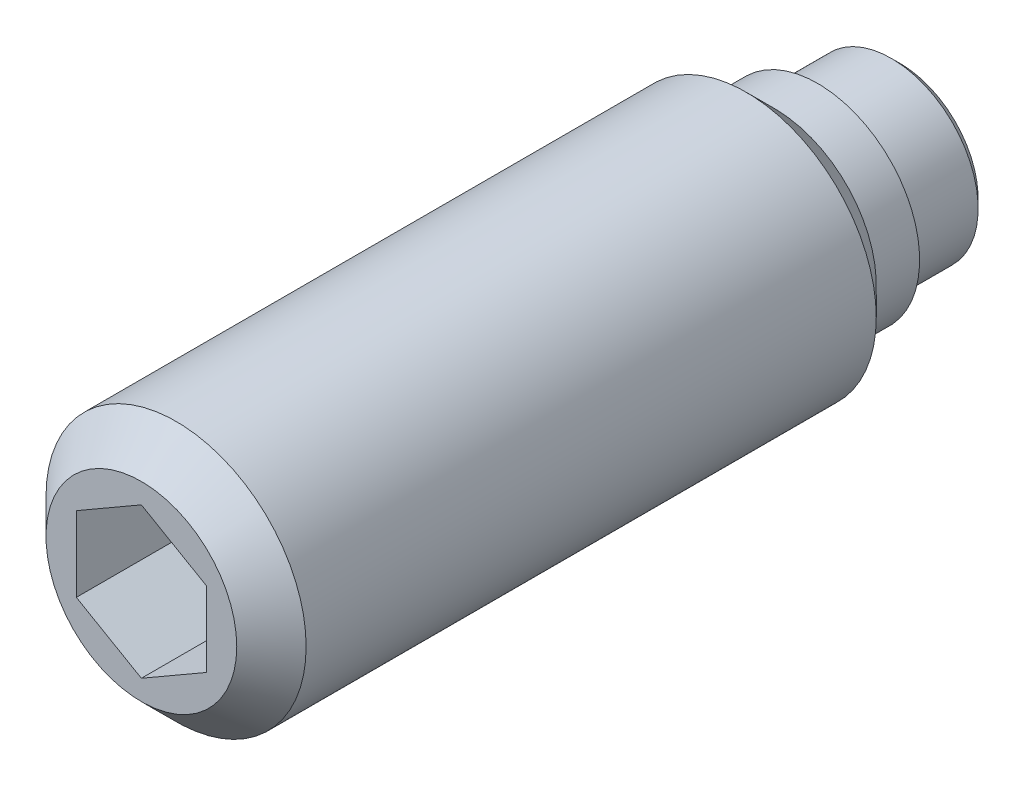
ISO-10303-21;
HEADER;
FILE_DESCRIPTION(('STEP AP214'),'2;1');
FILE_NAME('part.step','',(''),(''),'','','');
FILE_SCHEMA(('AUTOMOTIVE_DESIGN { 1 0 10303 214 1 1 1 1 }'));
ENDSEC;
DATA;
#1=APPLICATION_CONTEXT('core data for automotive mechanical design processes');
#2=APPLICATION_PROTOCOL_DEFINITION('international standard','automotive_design',2000,#1);
#3=PRODUCT_CONTEXT('',#1,'mechanical');
#4=PRODUCT('Part','Part','',(#3));
#5=PRODUCT_RELATED_PRODUCT_CATEGORY('part','',(#4));
#6=PRODUCT_DEFINITION_FORMATION('','',#4);
#7=PRODUCT_DEFINITION_CONTEXT('part definition',#1,'design');
#8=PRODUCT_DEFINITION('design','',#6,#7);
#9=PRODUCT_DEFINITION_SHAPE('','',#8);
#10=(LENGTH_UNIT() NAMED_UNIT(*) SI_UNIT(.MILLI.,.METRE.));
#11=(NAMED_UNIT(*) PLANE_ANGLE_UNIT() SI_UNIT($,.RADIAN.));
#12=(NAMED_UNIT(*) SI_UNIT($,.STERADIAN.) SOLID_ANGLE_UNIT());
#13=UNCERTAINTY_MEASURE_WITH_UNIT(LENGTH_MEASURE(1.E-05),#10,'distance_accuracy_value','');
#14=(GEOMETRIC_REPRESENTATION_CONTEXT(3) GLOBAL_UNCERTAINTY_ASSIGNED_CONTEXT((#13)) GLOBAL_UNIT_ASSIGNED_CONTEXT((#10,
#11,#12)) REPRESENTATION_CONTEXT('',''));
#15=CARTESIAN_POINT('',(0.,0.,0.));
#16=DIRECTION('',(0.,0.,1.));
#17=DIRECTION('',(1.,0.,0.));
#18=AXIS2_PLACEMENT_3D('',#15,#16,#17);
#19=CARTESIAN_POINT('',(0.,0.,1.9));
#20=DIRECTION('',(0.,0.,-1.));
#21=DIRECTION('',(-1.,0.,0.));
#22=AXIS2_PLACEMENT_3D('',#19,#20,#21);
#23=CYLINDRICAL_SURFACE('',#22,3.);
#24=CARTESIAN_POINT('',(0.,0.,3.55));
#25=DIRECTION('',(0.,0.,-1.));
#26=DIRECTION('',(-1.,0.,0.));
#27=AXIS2_PLACEMENT_3D('',#24,#25,#26);
#28=CIRCLE('',#27,3.);
#29=CARTESIAN_POINT('',(-3.,0.,3.55));
#30=VERTEX_POINT('',#29);
#31=EDGE_CURVE('E9',#30,#30,#28,.T.);
#32=ORIENTED_EDGE('',*,*,#31,.F.);
#33=EDGE_LOOP('',(#32));
#34=FACE_BOUND('',#33,.T.);
#35=CARTESIAN_POINT('',(0.,0.,16.7));
#36=DIRECTION('',(0.,0.,1.));
#37=DIRECTION('',(1.,0.,0.));
#38=AXIS2_PLACEMENT_3D('',#35,#36,#37);
#39=CIRCLE('',#38,3.);
#40=CARTESIAN_POINT('',(3.,0.,16.7));
#41=VERTEX_POINT('',#40);
#42=EDGE_CURVE('E123',#41,#41,#39,.T.);
#43=ORIENTED_EDGE('',*,*,#42,.F.);
#44=EDGE_LOOP('',(#43));
#45=FACE_BOUND('',#44,.T.);
#46=ADVANCED_FACE('F14',(#34,#45),#23,.T.);
#47=CARTESIAN_POINT('',(0.,0.,3.55));
#48=DIRECTION('',(0.,0.,1.));
#49=DIRECTION('',(1.,0.,0.));
#50=AXIS2_PLACEMENT_3D('',#47,#48,#49);
#51=CONICAL_SURFACE('',#50,3.,0.785398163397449);
#52=ORIENTED_EDGE('',*,*,#31,.T.);
#53=EDGE_LOOP('',(#52));
#54=FACE_BOUND('',#53,.T.);
#55=CARTESIAN_POINT('',(0.,0.,2.9));
#56=DIRECTION('',(0.,0.,-1.));
#57=DIRECTION('',(-1.,0.,0.));
#58=AXIS2_PLACEMENT_3D('',#55,#56,#57);
#59=CIRCLE('',#58,2.35);
#60=CARTESIAN_POINT('',(-2.35,0.,2.9));
#61=VERTEX_POINT('',#60);
#62=EDGE_CURVE('E21',#61,#61,#59,.T.);
#63=ORIENTED_EDGE('',*,*,#62,.F.);
#64=EDGE_LOOP('',(#63));
#65=FACE_BOUND('',#64,.T.);
#66=ADVANCED_FACE('F143',(#54,#65),#51,.T.);
#67=CARTESIAN_POINT('',(0.,0.,1.9));
#68=DIRECTION('',(0.,0.,-1.));
#69=DIRECTION('',(-1.,0.,0.));
#70=AXIS2_PLACEMENT_3D('',#67,#68,#69);
#71=CYLINDRICAL_SURFACE('',#70,2.35);
#72=ORIENTED_EDGE('',*,*,#62,.T.);
#73=EDGE_LOOP('',(#72));
#74=FACE_BOUND('',#73,.T.);
#75=CARTESIAN_POINT('',(0.,0.,1.9));
#76=DIRECTION('',(0.,0.,-1.));
#77=DIRECTION('',(-1.,0.,0.));
#78=AXIS2_PLACEMENT_3D('',#75,#76,#77);
#79=CIRCLE('',#78,2.35);
#80=CARTESIAN_POINT('',(-2.35,0.,1.9));
#81=VERTEX_POINT('',#80);
#82=EDGE_CURVE('E135',#81,#81,#79,.T.);
#83=ORIENTED_EDGE('',*,*,#82,.F.);
#84=EDGE_LOOP('',(#83));
#85=FACE_BOUND('',#84,.T.);
#86=ADVANCED_FACE('F140',(#74,#85),#71,.T.);
#87=CARTESIAN_POINT('',(0.,2.35,1.9));
#88=DIRECTION('',(0.,0.,1.));
#89=DIRECTION('',(1.,0.,0.));
#90=AXIS2_PLACEMENT_3D('',#87,#88,#89);
#91=PLANE('',#90);
#92=ORIENTED_EDGE('',*,*,#82,.T.);
#93=EDGE_LOOP('',(#92));
#94=FACE_BOUND('',#93,.T.);
#95=CARTESIAN_POINT('',(0.,0.,1.9));
#96=DIRECTION('',(0.,0.,-1.));
#97=DIRECTION('',(-1.,0.,0.));
#98=AXIS2_PLACEMENT_3D('',#95,#96,#97);
#99=CIRCLE('',#98,2.);
#100=CARTESIAN_POINT('',(-2.,0.,1.9));
#101=VERTEX_POINT('',#100);
#102=EDGE_CURVE('E132',#101,#101,#99,.T.);
#103=ORIENTED_EDGE('',*,*,#102,.F.);
#104=EDGE_LOOP('',(#103));
#105=FACE_BOUND('',#104,.T.);
#106=ADVANCED_FACE('F151',(#94,#105),#91,.F.);
#107=CARTESIAN_POINT('',(0.,0.,0.));
#108=DIRECTION('',(0.,0.,-1.));
#109=DIRECTION('',(-1.,0.,0.));
#110=AXIS2_PLACEMENT_3D('',#107,#108,#109);
#111=CYLINDRICAL_SURFACE('',#110,2.);
#112=CARTESIAN_POINT('',(0.,0.,0.2));
#113=DIRECTION('',(0.,0.,-1.));
#114=DIRECTION('',(-1.,0.,0.));
#115=AXIS2_PLACEMENT_3D('',#112,#113,#114);
#116=CIRCLE('',#115,2.);
#117=CARTESIAN_POINT('',(-2.,0.,0.2));
#118=VERTEX_POINT('',#117);
#119=EDGE_CURVE('E129',#118,#118,#116,.T.);
#120=ORIENTED_EDGE('',*,*,#119,.F.);
#121=EDGE_LOOP('',(#120));
#122=FACE_BOUND('',#121,.T.);
#123=ORIENTED_EDGE('',*,*,#102,.T.);
#124=EDGE_LOOP('',(#123));
#125=FACE_BOUND('',#124,.T.);
#126=ADVANCED_FACE('F157',(#122,#125),#111,.T.);
#127=CARTESIAN_POINT('',(0.,0.,0.2));
#128=DIRECTION('',(0.,0.,1.));
#129=DIRECTION('',(1.,0.,0.));
#130=AXIS2_PLACEMENT_3D('',#127,#128,#129);
#131=CONICAL_SURFACE('',#130,2.,0.785398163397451);
#132=CARTESIAN_POINT('',(0.,0.,0.));
#133=DIRECTION('',(0.,0.,-1.));
#134=DIRECTION('',(-1.,0.,0.));
#135=AXIS2_PLACEMENT_3D('',#132,#133,#134);
#136=CIRCLE('',#135,1.8);
#137=CARTESIAN_POINT('',(-1.8,0.,0.));
#138=VERTEX_POINT('',#137);
#139=EDGE_CURVE('E126',#138,#138,#136,.T.);
#140=ORIENTED_EDGE('',*,*,#139,.F.);
#141=EDGE_LOOP('',(#140));
#142=FACE_BOUND('',#141,.T.);
#143=ORIENTED_EDGE('',*,*,#119,.T.);
#144=EDGE_LOOP('',(#143));
#145=FACE_BOUND('',#144,.T.);
#146=ADVANCED_FACE('F161',(#142,#145),#131,.T.);
#147=CARTESIAN_POINT('',(0.,1.8,0.));
#148=DIRECTION('',(0.,0.,1.));
#149=DIRECTION('',(1.,0.,0.));
#150=AXIS2_PLACEMENT_3D('',#147,#148,#149);
#151=PLANE('',#150);
#152=ORIENTED_EDGE('',*,*,#139,.T.);
#153=EDGE_LOOP('',(#152));
#154=FACE_BOUND('',#153,.T.);
#155=ADVANCED_FACE('F165',(#154),#151,.F.);
#156=CARTESIAN_POINT('',(0.,0.,17.5));
#157=DIRECTION('',(0.,0.,-1.));
#158=DIRECTION('',(-1.,0.,0.));
#159=AXIS2_PLACEMENT_3D('',#156,#157,#158);
#160=CONICAL_SURFACE('',#159,2.2,0.785398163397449);
#161=ORIENTED_EDGE('',*,*,#42,.T.);
#162=EDGE_LOOP('',(#161));
#163=FACE_BOUND('',#162,.T.);
#164=CARTESIAN_POINT('',(0.,0.,17.5));
#165=DIRECTION('',(0.,0.,1.));
#166=DIRECTION('',(1.,0.,0.));
#167=AXIS2_PLACEMENT_3D('',#164,#165,#166);
#168=CIRCLE('',#167,2.2);
#169=CARTESIAN_POINT('',(2.2,0.,17.5));
#170=VERTEX_POINT('',#169);
#171=EDGE_CURVE('E115',#170,#170,#168,.T.);
#172=ORIENTED_EDGE('',*,*,#171,.F.);
#173=EDGE_LOOP('',(#172));
#174=FACE_BOUND('',#173,.T.);
#175=ADVANCED_FACE('F169',(#163,#174),#160,.T.);
#176=CARTESIAN_POINT('',(0.,0.,17.5));
#177=DIRECTION('',(0.,0.,1.));
#178=DIRECTION('',(1.,0.,0.));
#179=AXIS2_PLACEMENT_3D('',#176,#177,#178);
#180=PLANE('',#179);
#181=DIRECTION('',(0.866025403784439,-0.5,0.));
#182=VECTOR('',#181,1.);
#183=CARTESIAN_POINT('',(-1.5,-0.866025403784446,17.5));
#184=LINE('',#183,#182);
#185=CARTESIAN_POINT('',(-1.5,-0.866025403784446,17.5));
#186=VERTEX_POINT('',#185);
#187=CARTESIAN_POINT('',(0.,-1.73205080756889,17.5));
#188=VERTEX_POINT('',#187);
#189=EDGE_CURVE('E28',#186,#188,#184,.T.);
#190=ORIENTED_EDGE('',*,*,#189,.F.);
#191=DIRECTION('',(0.,-1.,0.));
#192=VECTOR('',#191,1.);
#193=CARTESIAN_POINT('',(-1.5,0.866025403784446,17.5));
#194=LINE('',#193,#192);
#195=CARTESIAN_POINT('',(-1.5,0.866025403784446,17.5));
#196=VERTEX_POINT('',#195);
#197=EDGE_CURVE('E111',#196,#186,#194,.T.);
#198=ORIENTED_EDGE('',*,*,#197,.F.);
#199=DIRECTION('',(-0.866025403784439,-0.5,0.));
#200=VECTOR('',#199,1.);
#201=CARTESIAN_POINT('',(0.,1.73205080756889,17.5));
#202=LINE('',#201,#200);
#203=CARTESIAN_POINT('',(0.,1.73205080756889,17.5));
#204=VERTEX_POINT('',#203);
#205=EDGE_CURVE('E109',#204,#196,#202,.T.);
#206=ORIENTED_EDGE('',*,*,#205,.F.);
#207=DIRECTION('',(-0.866025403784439,0.5,0.));
#208=VECTOR('',#207,1.);
#209=CARTESIAN_POINT('',(1.5,0.866025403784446,17.5));
#210=LINE('',#209,#208);
#211=CARTESIAN_POINT('',(1.5,0.866025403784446,17.5));
#212=VERTEX_POINT('',#211);
#213=EDGE_CURVE('E76',#212,#204,#210,.T.);
#214=ORIENTED_EDGE('',*,*,#213,.F.);
#215=DIRECTION('',(0.,1.,0.));
#216=VECTOR('',#215,1.);
#217=CARTESIAN_POINT('',(1.5,-0.866025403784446,17.5));
#218=LINE('',#217,#216);
#219=CARTESIAN_POINT('',(1.5,-0.866025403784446,17.5));
#220=VERTEX_POINT('',#219);
#221=EDGE_CURVE('E105',#220,#212,#218,.T.);
#222=ORIENTED_EDGE('',*,*,#221,.F.);
#223=DIRECTION('',(0.866025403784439,0.5,0.));
#224=VECTOR('',#223,1.);
#225=CARTESIAN_POINT('',(0.,-1.73205080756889,17.5));
#226=LINE('',#225,#224);
#227=EDGE_CURVE('E102',#188,#220,#226,.T.);
#228=ORIENTED_EDGE('',*,*,#227,.F.);
#229=EDGE_LOOP('',(#190,#198,#206,#214,#222,#228));
#230=FACE_BOUND('',#229,.T.);
#231=ORIENTED_EDGE('',*,*,#171,.T.);
#232=EDGE_LOOP('',(#231));
#233=FACE_BOUND('',#232,.T.);
#234=ADVANCED_FACE('F173',(#230,#233),#180,.T.);
#235=CARTESIAN_POINT('',(-1.5,-0.866025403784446,14.));
#236=DIRECTION('',(-0.5,-0.866025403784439,0.));
#237=DIRECTION('',(0.866025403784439,-0.5,0.));
#238=AXIS2_PLACEMENT_3D('',#235,#236,#237);
#239=PLANE('',#238);
#240=ORIENTED_EDGE('',*,*,#189,.T.);
#241=DIRECTION('',(0.,0.,1.));
#242=VECTOR('',#241,1.);
#243=CARTESIAN_POINT('',(0.,-1.73205080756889,14.));
#244=LINE('',#243,#242);
#245=CARTESIAN_POINT('',(0.,-1.73205080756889,14.));
#246=VERTEX_POINT('',#245);
#247=EDGE_CURVE('E58',#246,#188,#244,.T.);
#248=ORIENTED_EDGE('',*,*,#247,.F.);
#249=DIRECTION('',(0.866025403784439,-0.5,0.));
#250=VECTOR('',#249,1.);
#251=CARTESIAN_POINT('',(-1.5,-0.866025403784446,14.));
#252=LINE('',#251,#250);
#253=CARTESIAN_POINT('',(-1.5,-0.866025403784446,14.));
#254=VERTEX_POINT('',#253);
#255=EDGE_CURVE('E113',#254,#246,#252,.T.);
#256=ORIENTED_EDGE('',*,*,#255,.F.);
#257=DIRECTION('',(0.,0.,1.));
#258=VECTOR('',#257,1.);
#259=CARTESIAN_POINT('',(-1.5,-0.866025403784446,14.));
#260=LINE('',#259,#258);
#261=EDGE_CURVE('E36',#254,#186,#260,.T.);
#262=ORIENTED_EDGE('',*,*,#261,.T.);
#263=EDGE_LOOP('',(#240,#248,#256,#262));
#264=FACE_BOUND('',#263,.T.);
#265=ADVANCED_FACE('F177',(#264),#239,.F.);
#266=CARTESIAN_POINT('',(-1.5,0.866025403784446,14.));
#267=DIRECTION('',(-1.,0.,0.));
#268=DIRECTION('',(0.,0.,1.));
#269=AXIS2_PLACEMENT_3D('',#266,#267,#268);
#270=PLANE('',#269);
#271=ORIENTED_EDGE('',*,*,#197,.T.);
#272=ORIENTED_EDGE('',*,*,#261,.F.);
#273=DIRECTION('',(0.,-1.,0.));
#274=VECTOR('',#273,1.);
#275=CARTESIAN_POINT('',(-1.5,0.866025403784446,14.));
#276=LINE('',#275,#274);
#277=CARTESIAN_POINT('',(-1.5,0.866025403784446,14.));
#278=VERTEX_POINT('',#277);
#279=EDGE_CURVE('E88',#278,#254,#276,.T.);
#280=ORIENTED_EDGE('',*,*,#279,.F.);
#281=DIRECTION('',(0.,0.,1.));
#282=VECTOR('',#281,1.);
#283=CARTESIAN_POINT('',(-1.5,0.866025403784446,14.));
#284=LINE('',#283,#282);
#285=EDGE_CURVE('E80',#278,#196,#284,.T.);
#286=ORIENTED_EDGE('',*,*,#285,.T.);
#287=EDGE_LOOP('',(#271,#272,#280,#286));
#288=FACE_BOUND('',#287,.T.);
#289=ADVANCED_FACE('F181',(#288),#270,.F.);
#290=CARTESIAN_POINT('',(0.,1.73205080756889,14.));
#291=DIRECTION('',(-0.5,0.866025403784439,0.));
#292=DIRECTION('',(-0.866025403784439,-0.5,0.));
#293=AXIS2_PLACEMENT_3D('',#290,#291,#292);
#294=PLANE('',#293);
#295=ORIENTED_EDGE('',*,*,#205,.T.);
#296=ORIENTED_EDGE('',*,*,#285,.F.);
#297=DIRECTION('',(-0.866025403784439,-0.5,0.));
#298=VECTOR('',#297,1.);
#299=CARTESIAN_POINT('',(0.,1.73205080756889,14.));
#300=LINE('',#299,#298);
#301=CARTESIAN_POINT('',(0.,1.73205080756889,14.));
#302=VERTEX_POINT('',#301);
#303=EDGE_CURVE('E84',#302,#278,#300,.T.);
#304=ORIENTED_EDGE('',*,*,#303,.F.);
#305=DIRECTION('',(0.,0.,1.));
#306=VECTOR('',#305,1.);
#307=CARTESIAN_POINT('',(0.,1.73205080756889,14.));
#308=LINE('',#307,#306);
#309=EDGE_CURVE('E69',#302,#204,#308,.T.);
#310=ORIENTED_EDGE('',*,*,#309,.T.);
#311=EDGE_LOOP('',(#295,#296,#304,#310));
#312=FACE_BOUND('',#311,.T.);
#313=ADVANCED_FACE('F85',(#312),#294,.F.);
#314=CARTESIAN_POINT('',(1.5,0.866025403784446,14.));
#315=DIRECTION('',(0.5,0.866025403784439,0.));
#316=DIRECTION('',(-0.866025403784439,0.5,0.));
#317=AXIS2_PLACEMENT_3D('',#314,#315,#316);
#318=PLANE('',#317);
#319=ORIENTED_EDGE('',*,*,#213,.T.);
#320=ORIENTED_EDGE('',*,*,#309,.F.);
#321=DIRECTION('',(-0.866025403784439,0.5,0.));
#322=VECTOR('',#321,1.);
#323=CARTESIAN_POINT('',(1.5,0.866025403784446,14.));
#324=LINE('',#323,#322);
#325=CARTESIAN_POINT('',(1.5,0.866025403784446,14.));
#326=VERTEX_POINT('',#325);
#327=EDGE_CURVE('E73',#326,#302,#324,.T.);
#328=ORIENTED_EDGE('',*,*,#327,.F.);
#329=DIRECTION('',(0.,0.,1.));
#330=VECTOR('',#329,1.);
#331=CARTESIAN_POINT('',(1.5,0.866025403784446,14.));
#332=LINE('',#331,#330);
#333=EDGE_CURVE('E81',#326,#212,#332,.T.);
#334=ORIENTED_EDGE('',*,*,#333,.T.);
#335=EDGE_LOOP('',(#319,#320,#328,#334));
#336=FACE_BOUND('',#335,.T.);
#337=ADVANCED_FACE('F71',(#336),#318,.F.);
#338=CARTESIAN_POINT('',(1.5,-0.866025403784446,14.));
#339=DIRECTION('',(1.,0.,0.));
#340=DIRECTION('',(0.,0.,-1.));
#341=AXIS2_PLACEMENT_3D('',#338,#339,#340);
#342=PLANE('',#341);
#343=ORIENTED_EDGE('',*,*,#221,.T.);
#344=ORIENTED_EDGE('',*,*,#333,.F.);
#345=DIRECTION('',(0.,1.,0.));
#346=VECTOR('',#345,1.);
#347=CARTESIAN_POINT('',(1.5,-0.866025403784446,14.));
#348=LINE('',#347,#346);
#349=CARTESIAN_POINT('',(1.5,-0.866025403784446,14.));
#350=VERTEX_POINT('',#349);
#351=EDGE_CURVE('E94',#350,#326,#348,.T.);
#352=ORIENTED_EDGE('',*,*,#351,.F.);
#353=DIRECTION('',(0.,0.,1.));
#354=VECTOR('',#353,1.);
#355=CARTESIAN_POINT('',(1.5,-0.866025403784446,14.));
#356=LINE('',#355,#354);
#357=EDGE_CURVE('E118',#350,#220,#356,.T.);
#358=ORIENTED_EDGE('',*,*,#357,.T.);
#359=EDGE_LOOP('',(#343,#344,#352,#358));
#360=FACE_BOUND('',#359,.T.);
#361=ADVANCED_FACE('F185',(#360),#342,.F.);
#362=CARTESIAN_POINT('',(0.,-1.73205080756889,14.));
#363=DIRECTION('',(0.5,-0.866025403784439,0.));
#364=DIRECTION('',(0.866025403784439,0.5,0.));
#365=AXIS2_PLACEMENT_3D('',#362,#363,#364);
#366=PLANE('',#365);
#367=ORIENTED_EDGE('',*,*,#227,.T.);
#368=ORIENTED_EDGE('',*,*,#357,.F.);
#369=DIRECTION('',(0.866025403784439,0.5,0.));
#370=VECTOR('',#369,1.);
#371=CARTESIAN_POINT('',(0.,-1.73205080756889,14.));
#372=LINE('',#371,#370);
#373=EDGE_CURVE('E96',#246,#350,#372,.T.);
#374=ORIENTED_EDGE('',*,*,#373,.F.);
#375=ORIENTED_EDGE('',*,*,#247,.T.);
#376=EDGE_LOOP('',(#367,#368,#374,#375));
#377=FACE_BOUND('',#376,.T.);
#378=ADVANCED_FACE('F182',(#377),#366,.F.);
#379=CARTESIAN_POINT('',(0.,0.,14.));
#380=DIRECTION('',(0.,0.,1.));
#381=DIRECTION('',(1.,0.,0.));
#382=AXIS2_PLACEMENT_3D('',#379,#380,#381);
#383=PLANE('',#382);
#384=ORIENTED_EDGE('',*,*,#255,.T.);
#385=ORIENTED_EDGE('',*,*,#373,.T.);
#386=ORIENTED_EDGE('',*,*,#351,.T.);
#387=ORIENTED_EDGE('',*,*,#327,.T.);
#388=ORIENTED_EDGE('',*,*,#303,.T.);
#389=ORIENTED_EDGE('',*,*,#279,.T.);
#390=EDGE_LOOP('',(#384,#385,#386,#387,#388,#389));
#391=FACE_BOUND('',#390,.T.);
#392=ADVANCED_FACE('F91',(#391),#383,.T.);
#393=CLOSED_SHELL('',(#46,#66,#86,#106,#126,#146,#155,#175,#234,#265,#289,#313,#337,#361,#378,#392));
#394=MANIFOLD_SOLID_BREP('B1',#393);
#395=ADVANCED_BREP_SHAPE_REPRESENTATION('',(#18,#394),#14);
#396=SHAPE_DEFINITION_REPRESENTATION(#9,#395);
ENDSEC;
END-ISO-10303-21;
